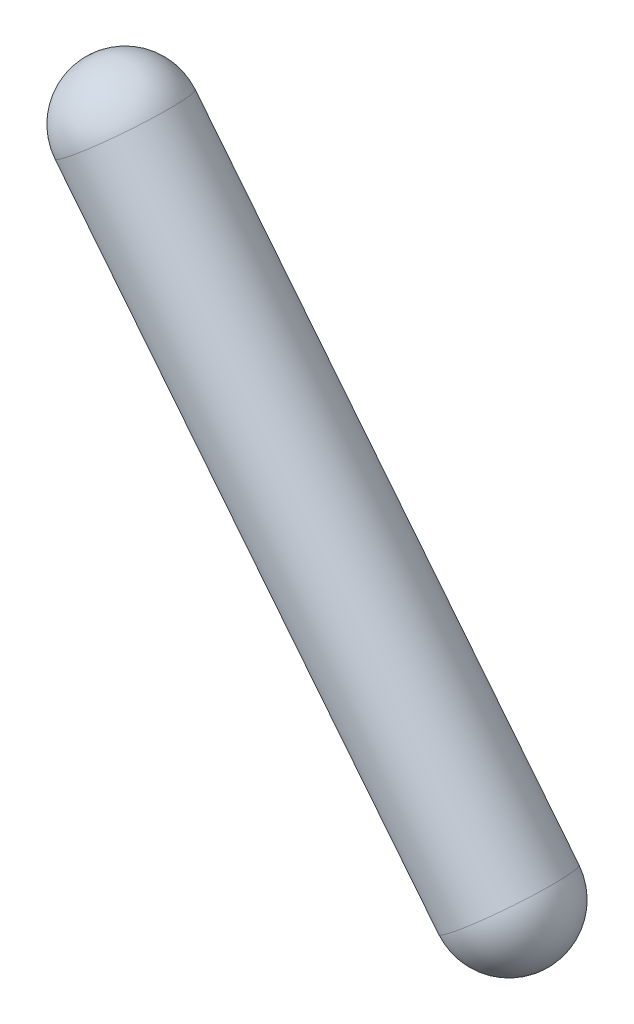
ISO-10303-21;
HEADER;
FILE_DESCRIPTION(('STEP AP214'),'2;1');
FILE_NAME('part.step','',(''),(''),'','','');
FILE_SCHEMA(('AUTOMOTIVE_DESIGN { 1 0 10303 214 1 1 1 1 }'));
ENDSEC;
DATA;
#1=APPLICATION_CONTEXT('core data for automotive mechanical design processes');
#2=APPLICATION_PROTOCOL_DEFINITION('international standard','automotive_design',2000,#1);
#3=PRODUCT_CONTEXT('',#1,'mechanical');
#4=PRODUCT('Part','Part','',(#3));
#5=PRODUCT_RELATED_PRODUCT_CATEGORY('part','',(#4));
#6=PRODUCT_DEFINITION_FORMATION('','',#4);
#7=PRODUCT_DEFINITION_CONTEXT('part definition',#1,'design');
#8=PRODUCT_DEFINITION('design','',#6,#7);
#9=PRODUCT_DEFINITION_SHAPE('','',#8);
#10=(LENGTH_UNIT() NAMED_UNIT(*) SI_UNIT(.MILLI.,.METRE.));
#11=(NAMED_UNIT(*) PLANE_ANGLE_UNIT() SI_UNIT($,.RADIAN.));
#12=(NAMED_UNIT(*) SI_UNIT($,.STERADIAN.) SOLID_ANGLE_UNIT());
#13=UNCERTAINTY_MEASURE_WITH_UNIT(LENGTH_MEASURE(1.E-05),#10,'distance_accuracy_value','');
#14=(GEOMETRIC_REPRESENTATION_CONTEXT(3) GLOBAL_UNCERTAINTY_ASSIGNED_CONTEXT((#13)) GLOBAL_UNIT_ASSIGNED_CONTEXT((#10,
#11,#12)) REPRESENTATION_CONTEXT('',''));
#15=CARTESIAN_POINT('',(0.,0.,0.));
#16=DIRECTION('',(0.,0.,1.));
#17=DIRECTION('',(1.,0.,0.));
#18=AXIS2_PLACEMENT_3D('',#15,#16,#17);
#19=CARTESIAN_POINT('',(31.,-98.,0.));
#20=DIRECTION('',(-0.624695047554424,0.780868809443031,0.));
#21=DIRECTION('',(0.,0.,-1.));
#22=AXIS2_PLACEMENT_3D('',#19,#20,#21);
#23=CYLINDRICAL_SURFACE('',#22,1.5);
#24=CARTESIAN_POINT('',(20.6,-85.,0.));
#25=DIRECTION('',(0.624695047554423,-0.780868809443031,0.));
#26=DIRECTION('',(0.780868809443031,0.624695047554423,0.));
#27=AXIS2_PLACEMENT_3D('',#24,#25,#26);
#28=CIRCLE('',#27,1.5);
#29=CARTESIAN_POINT('',(20.6,-85.,-1.5));
#30=VERTEX_POINT('',#29);
#31=CARTESIAN_POINT('',(20.6,-85.,1.5));
#32=VERTEX_POINT('',#31);
#33=EDGE_CURVE('E11',#30,#32,#28,.T.);
#34=ORIENTED_EDGE('',*,*,#33,.T.);
#35=CARTESIAN_POINT('',(20.6,-85.,0.));
#36=DIRECTION('',(-0.624695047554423,0.780868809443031,0.));
#37=DIRECTION('',(-0.780868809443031,-0.624695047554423,0.));
#38=AXIS2_PLACEMENT_3D('',#35,#36,#37);
#39=CIRCLE('',#38,1.5);
#40=EDGE_CURVE('E24',#30,#32,#39,.T.);
#41=ORIENTED_EDGE('',*,*,#40,.F.);
#42=EDGE_LOOP('',(#34,#41));
#43=FACE_BOUND('',#42,.T.);
#44=CARTESIAN_POINT('',(31.,-98.,0.));
#45=DIRECTION('',(0.624695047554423,-0.780868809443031,0.));
#46=DIRECTION('',(0.780868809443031,0.624695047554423,0.));
#47=AXIS2_PLACEMENT_3D('',#44,#45,#46);
#48=CIRCLE('',#47,1.5);
#49=CARTESIAN_POINT('',(31.,-98.,-1.5));
#50=VERTEX_POINT('',#49);
#51=CARTESIAN_POINT('',(31.,-98.,1.5));
#52=VERTEX_POINT('',#51);
#53=EDGE_CURVE('E30',#50,#52,#48,.T.);
#54=ORIENTED_EDGE('',*,*,#53,.F.);
#55=CARTESIAN_POINT('',(31.,-98.,0.));
#56=DIRECTION('',(-0.624695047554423,0.780868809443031,0.));
#57=DIRECTION('',(-0.780868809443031,-0.624695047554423,0.));
#58=AXIS2_PLACEMENT_3D('',#55,#56,#57);
#59=CIRCLE('',#58,1.5);
#60=EDGE_CURVE('E40',#50,#52,#59,.T.);
#61=ORIENTED_EDGE('',*,*,#60,.T.);
#62=EDGE_LOOP('',(#54,#61));
#63=FACE_BOUND('',#62,.T.);
#64=ADVANCED_FACE('F16',(#43,#63),#23,.T.);
#65=CARTESIAN_POINT('',(20.6,-85.,0.));
#66=DIRECTION('',(0.,0.,1.));
#67=DIRECTION('',(0.780868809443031,0.624695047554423,0.));
#68=AXIS2_PLACEMENT_3D('',#65,#66,#67);
#69=SPHERICAL_SURFACE('',#68,1.5);
#70=CARTESIAN_POINT('',(20.6,-85.,0.));
#71=DIRECTION('',(0.624695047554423,-0.780868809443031,0.));
#72=DIRECTION('',(0.780868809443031,0.624695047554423,0.));
#73=AXIS2_PLACEMENT_3D('',#70,#71,#72);
#74=SPHERICAL_SURFACE('',#73,1.5);
#75=ORIENTED_EDGE('',*,*,#33,.F.);
#76=ORIENTED_EDGE('',*,*,#40,.T.);
#77=EDGE_LOOP('',(#75,#76));
#78=FACE_BOUND('',#77,.T.);
#79=ADVANCED_FACE('F62',(#78),#74,.T.);
#80=CARTESIAN_POINT('',(31.,-98.,0.));
#81=DIRECTION('',(0.,0.,1.));
#82=DIRECTION('',(-0.780868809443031,-0.624695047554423,0.));
#83=AXIS2_PLACEMENT_3D('',#80,#81,#82);
#84=SPHERICAL_SURFACE('',#83,1.5);
#85=CARTESIAN_POINT('',(31.,-98.,0.));
#86=DIRECTION('',(-0.624695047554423,0.780868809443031,0.));
#87=DIRECTION('',(-0.780868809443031,-0.624695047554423,0.));
#88=AXIS2_PLACEMENT_3D('',#85,#86,#87);
#89=SPHERICAL_SURFACE('',#88,1.5);
#90=ORIENTED_EDGE('',*,*,#60,.F.);
#91=ORIENTED_EDGE('',*,*,#53,.T.);
#92=EDGE_LOOP('',(#90,#91));
#93=FACE_BOUND('',#92,.T.);
#94=ADVANCED_FACE('F41',(#93),#89,.T.);
#95=CLOSED_SHELL('',(#64,#79,#94));
#96=MANIFOLD_SOLID_BREP('B1',#95);
#97=ADVANCED_BREP_SHAPE_REPRESENTATION('',(#18,#96),#14);
#98=SHAPE_DEFINITION_REPRESENTATION(#9,#97);
ENDSEC;
END-ISO-10303-21;
